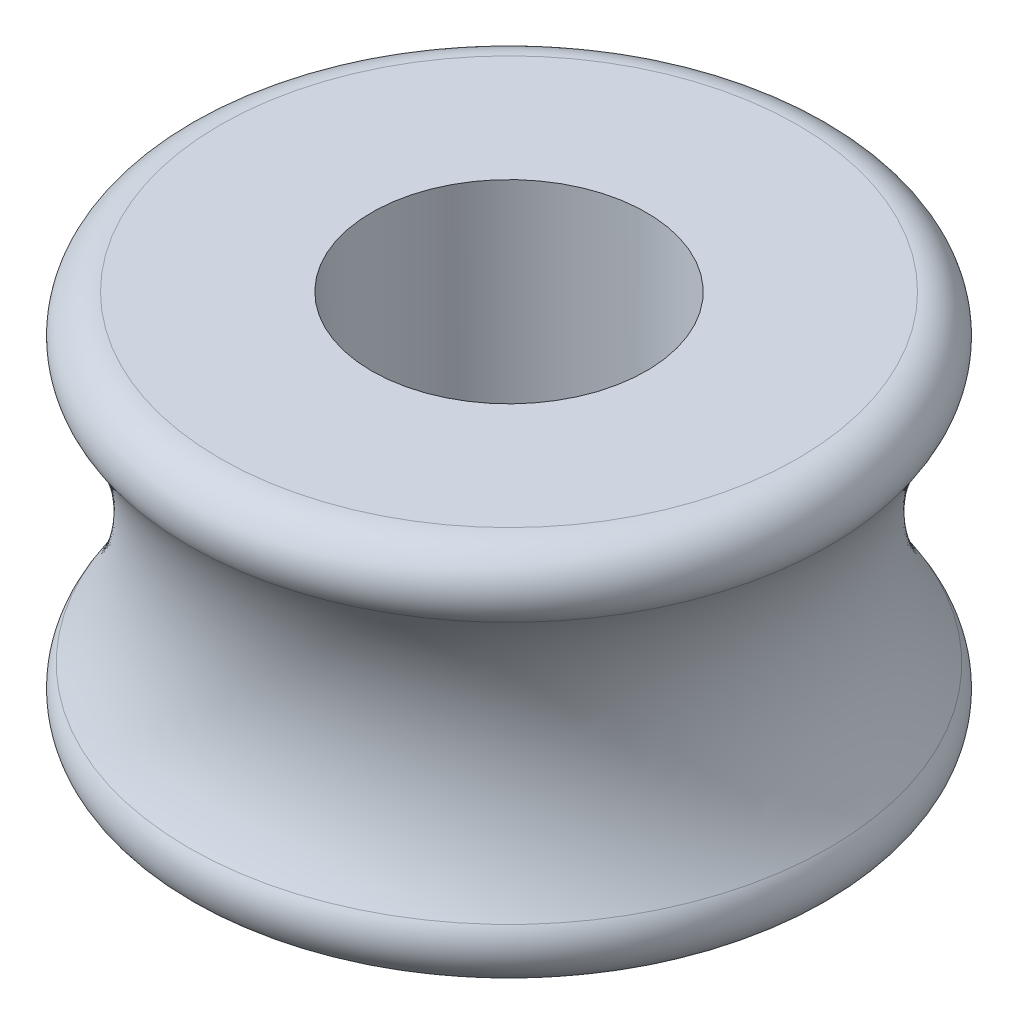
from build123d import *

# Parameters (mm, degrees)
CHAMFER1_SIZE = 0.5


with BuildPart() as part:
    # Sketch1 → Revolve1 (revolve)
    with BuildSketch(Plane.XY, mode=Mode.PRIVATE) as revolve1_sk:
        with BuildLine():
            Line((-3.786031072, 0), (-1.8, 0))
            Line((-1.8, 0), (-1.8, -5))
            Line((-1.8, -5), (-3.786031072, -5))
            ThreePointArc((-3.786031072, -5), (-4.229233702, -4.731455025), (-4.196356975, -4.214285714))
            ThreePointArc((-4.196356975, -4.214285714), (-3.658312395, -2.5), (-4.196356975, -0.785714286))
            ThreePointArc((-4.196356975, -0.785714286), (-4.229233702, -0.268544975), (-3.786031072, 0))
        make_face()
    revolve(revolve1_sk.sketch.rotate(Axis((0, 0, 0), (0, -1, 0)), 270), axis=Axis((0, 0, 0), (0, -1, 0)))

    # Chamfer1
    chamfer1_edges = [part.edges().sort_by_distance(p)[0] for p in [
        (0, -5, -1.8),
    ]]
    chamfer(chamfer1_edges, length=CHAMFER1_SIZE)


solid = part.part
